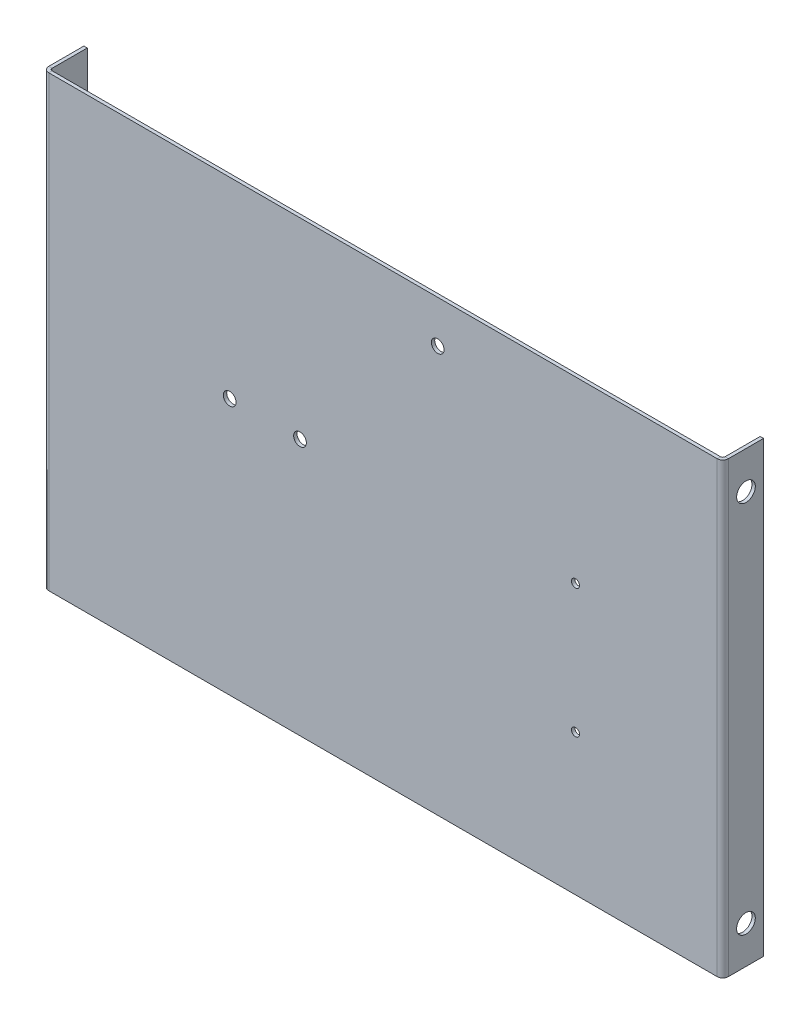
ISO-10303-21;
HEADER;
FILE_DESCRIPTION(('STEP AP214'),'2;1');
FILE_NAME('part.step','',(''),(''),'','','');
FILE_SCHEMA(('AUTOMOTIVE_DESIGN { 1 0 10303 214 1 1 1 1 }'));
ENDSEC;
DATA;
#1=APPLICATION_CONTEXT('core data for automotive mechanical design processes');
#2=APPLICATION_PROTOCOL_DEFINITION('international standard','automotive_design',2000,#1);
#3=PRODUCT_CONTEXT('',#1,'mechanical');
#4=PRODUCT('Part','Part','',(#3));
#5=PRODUCT_RELATED_PRODUCT_CATEGORY('part','',(#4));
#6=PRODUCT_DEFINITION_FORMATION('','',#4);
#7=PRODUCT_DEFINITION_CONTEXT('part definition',#1,'design');
#8=PRODUCT_DEFINITION('design','',#6,#7);
#9=PRODUCT_DEFINITION_SHAPE('','',#8);
#10=(LENGTH_UNIT() NAMED_UNIT(*) SI_UNIT(.MILLI.,.METRE.));
#11=(NAMED_UNIT(*) PLANE_ANGLE_UNIT() SI_UNIT($,.RADIAN.));
#12=(NAMED_UNIT(*) SI_UNIT($,.STERADIAN.) SOLID_ANGLE_UNIT());
#13=UNCERTAINTY_MEASURE_WITH_UNIT(LENGTH_MEASURE(1.E-05),#10,'distance_accuracy_value','');
#14=(GEOMETRIC_REPRESENTATION_CONTEXT(3) GLOBAL_UNCERTAINTY_ASSIGNED_CONTEXT((#13)) GLOBAL_UNIT_ASSIGNED_CONTEXT((#10,
#11,#12)) REPRESENTATION_CONTEXT('',''));
#15=CARTESIAN_POINT('',(0.,0.,0.));
#16=DIRECTION('',(0.,0.,1.));
#17=DIRECTION('',(1.,0.,0.));
#18=AXIS2_PLACEMENT_3D('',#15,#16,#17);
#19=CARTESIAN_POINT('',(230.886,152.4,0.));
#20=DIRECTION('',(-1.,0.,0.));
#21=DIRECTION('',(0.,0.,1.));
#22=AXIS2_PLACEMENT_3D('',#19,#20,#21);
#23=PLANE('',#22);
#24=CARTESIAN_POINT('',(230.886,127.,-13.462));
#25=DIRECTION('',(1.,0.,0.));
#26=DIRECTION('',(0.,0.,-1.));
#27=AXIS2_PLACEMENT_3D('',#24,#25,#26);
#28=CIRCLE('',#27,6.35);
#29=CARTESIAN_POINT('',(230.886,127.,-19.812));
#30=VERTEX_POINT('',#29);
#31=EDGE_CURVE('E309',#30,#30,#28,.T.);
#32=ORIENTED_EDGE('',*,*,#31,.F.);
#33=EDGE_LOOP('',(#32));
#34=FACE_BOUND('',#33,.T.);
#35=DIRECTION('',(0.,0.,-1.));
#36=VECTOR('',#35,1.);
#37=CARTESIAN_POINT('',(230.886,-152.4,0.));
#38=LINE('',#37,#36);
#39=CARTESIAN_POINT('',(230.886,-152.4,-1.52400000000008));
#40=VERTEX_POINT('',#39);
#41=CARTESIAN_POINT('',(230.886,-152.4,-25.4000000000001));
#42=VERTEX_POINT('',#41);
#43=EDGE_CURVE('E174',#40,#42,#38,.T.);
#44=ORIENTED_EDGE('',*,*,#43,.T.);
#45=DIRECTION('',(0.,-1.,0.));
#46=VECTOR('',#45,1.);
#47=CARTESIAN_POINT('',(230.886,152.4,-25.4000000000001));
#48=LINE('',#47,#46);
#49=CARTESIAN_POINT('',(230.886,152.4,-25.4000000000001));
#50=VERTEX_POINT('',#49);
#51=EDGE_CURVE('E227',#50,#42,#48,.T.);
#52=ORIENTED_EDGE('',*,*,#51,.F.);
#53=DIRECTION('',(0.,0.,-1.));
#54=VECTOR('',#53,1.);
#55=CARTESIAN_POINT('',(230.886,152.4,0.));
#56=LINE('',#55,#54);
#57=CARTESIAN_POINT('',(230.886,152.4,-1.52400000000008));
#58=VERTEX_POINT('',#57);
#59=EDGE_CURVE('E109',#58,#50,#56,.T.);
#60=ORIENTED_EDGE('',*,*,#59,.F.);
#61=DIRECTION('',(0.,-1.,0.));
#62=VECTOR('',#61,1.);
#63=CARTESIAN_POINT('',(230.886,152.4,-1.52400000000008));
#64=LINE('',#63,#62);
#65=EDGE_CURVE('E170',#58,#40,#64,.T.);
#66=ORIENTED_EDGE('',*,*,#65,.T.);
#67=EDGE_LOOP('',(#44,#52,#60,#66));
#68=FACE_BOUND('',#67,.T.);
#69=CARTESIAN_POINT('',(230.886,-127.,-13.462));
#70=DIRECTION('',(1.,0.,0.));
#71=DIRECTION('',(0.,0.,1.));
#72=AXIS2_PLACEMENT_3D('',#69,#70,#71);
#73=CIRCLE('',#72,6.34999999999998);
#74=CARTESIAN_POINT('',(230.886,-127.,-7.11200000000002));
#75=VERTEX_POINT('',#74);
#76=EDGE_CURVE('E315',#75,#75,#73,.T.);
#77=ORIENTED_EDGE('',*,*,#76,.F.);
#78=EDGE_LOOP('',(#77));
#79=FACE_BOUND('',#78,.T.);
#80=ADVANCED_FACE('F38',(#34,#68,#79),#23,.F.);
#81=CARTESIAN_POINT('',(228.6,152.4,0.));
#82=DIRECTION('',(-1.,0.,0.));
#83=DIRECTION('',(0.,0.,1.));
#84=AXIS2_PLACEMENT_3D('',#81,#82,#83);
#85=PLANE('',#84);
#86=CARTESIAN_POINT('',(228.6,127.,-13.462));
#87=DIRECTION('',(1.,0.,0.));
#88=DIRECTION('',(0.,0.,-1.));
#89=AXIS2_PLACEMENT_3D('',#86,#87,#88);
#90=CIRCLE('',#89,6.35);
#91=CARTESIAN_POINT('',(228.6,127.,-19.812));
#92=VERTEX_POINT('',#91);
#93=EDGE_CURVE('E312',#92,#92,#90,.T.);
#94=ORIENTED_EDGE('',*,*,#93,.T.);
#95=EDGE_LOOP('',(#94));
#96=FACE_BOUND('',#95,.T.);
#97=DIRECTION('',(0.,0.,-1.));
#98=VECTOR('',#97,1.);
#99=CARTESIAN_POINT('',(228.6,-152.4,0.));
#100=LINE('',#99,#98);
#101=CARTESIAN_POINT('',(228.6,-152.4,-1.52400000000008));
#102=VERTEX_POINT('',#101);
#103=CARTESIAN_POINT('',(228.6,-152.4,-25.4000000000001));
#104=VERTEX_POINT('',#103);
#105=EDGE_CURVE('E181',#102,#104,#100,.T.);
#106=ORIENTED_EDGE('',*,*,#105,.F.);
#107=DIRECTION('',(0.,-1.,0.));
#108=VECTOR('',#107,1.);
#109=CARTESIAN_POINT('',(228.6,152.4,-1.52400000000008));
#110=LINE('',#109,#108);
#111=CARTESIAN_POINT('',(228.6,152.4,-1.52400000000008));
#112=VERTEX_POINT('',#111);
#113=EDGE_CURVE('E222',#112,#102,#110,.T.);
#114=ORIENTED_EDGE('',*,*,#113,.F.);
#115=DIRECTION('',(0.,0.,-1.));
#116=VECTOR('',#115,1.);
#117=CARTESIAN_POINT('',(228.6,152.4,0.));
#118=LINE('',#117,#116);
#119=CARTESIAN_POINT('',(228.6,152.4,-25.4000000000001));
#120=VERTEX_POINT('',#119);
#121=EDGE_CURVE('E263',#112,#120,#118,.T.);
#122=ORIENTED_EDGE('',*,*,#121,.T.);
#123=DIRECTION('',(0.,-1.,0.));
#124=VECTOR('',#123,1.);
#125=CARTESIAN_POINT('',(228.6,152.4,-25.4000000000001));
#126=LINE('',#125,#124);
#127=EDGE_CURVE('E225',#120,#104,#126,.T.);
#128=ORIENTED_EDGE('',*,*,#127,.T.);
#129=EDGE_LOOP('',(#106,#114,#122,#128));
#130=FACE_BOUND('',#129,.T.);
#131=CARTESIAN_POINT('',(228.6,-127.,-13.462));
#132=DIRECTION('',(1.,0.,0.));
#133=DIRECTION('',(0.,0.,1.));
#134=AXIS2_PLACEMENT_3D('',#131,#132,#133);
#135=CIRCLE('',#134,6.34999999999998);
#136=CARTESIAN_POINT('',(228.6,-127.,-7.11200000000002));
#137=VERTEX_POINT('',#136);
#138=EDGE_CURVE('E318',#137,#137,#135,.T.);
#139=ORIENTED_EDGE('',*,*,#138,.T.);
#140=EDGE_LOOP('',(#139));
#141=FACE_BOUND('',#140,.T.);
#142=ADVANCED_FACE('F328',(#96,#130,#141),#85,.T.);
#143=CARTESIAN_POINT('',(-227.076,152.4,0.));
#144=DIRECTION('',(0.,1.,0.));
#145=DIRECTION('',(0.,0.,1.));
#146=AXIS2_PLACEMENT_3D('',#143,#144,#145);
#147=PLANE('',#146);
#148=DIRECTION('',(0.,0.,1.));
#149=VECTOR('',#148,1.);
#150=CARTESIAN_POINT('',(-227.076,152.4,0.));
#151=LINE('',#150,#149);
#152=CARTESIAN_POINT('',(-227.076,152.4,0.));
#153=VERTEX_POINT('',#152);
#154=CARTESIAN_POINT('',(-227.076,152.4,2.286));
#155=VERTEX_POINT('',#154);
#156=EDGE_CURVE('E11',#153,#155,#151,.T.);
#157=ORIENTED_EDGE('',*,*,#156,.F.);
#158=CARTESIAN_POINT('',(-227.076,152.4,-1.524));
#159=DIRECTION('',(0.,-1.,0.));
#160=DIRECTION('',(0.,0.,-1.));
#161=AXIS2_PLACEMENT_3D('',#158,#159,#160);
#162=CIRCLE('',#161,1.524);
#163=CARTESIAN_POINT('',(-228.6,152.4,-1.524));
#164=VERTEX_POINT('',#163);
#165=EDGE_CURVE('E250',#164,#153,#162,.F.);
#166=ORIENTED_EDGE('',*,*,#165,.F.);
#167=DIRECTION('',(1.,0.,0.));
#168=VECTOR('',#167,1.);
#169=CARTESIAN_POINT('',(-230.886,152.4,-1.524));
#170=LINE('',#169,#168);
#171=CARTESIAN_POINT('',(-230.886,152.4,-1.524));
#172=VERTEX_POINT('',#171);
#173=EDGE_CURVE('E47',#172,#164,#170,.T.);
#174=ORIENTED_EDGE('',*,*,#173,.F.);
#175=CARTESIAN_POINT('',(-227.076,152.4,-1.524));
#176=DIRECTION('',(0.,1.,0.));
#177=DIRECTION('',(1.,0.,0.));
#178=AXIS2_PLACEMENT_3D('',#175,#176,#177);
#179=CIRCLE('',#178,3.81);
#180=EDGE_CURVE('E148',#172,#155,#179,.T.);
#181=ORIENTED_EDGE('',*,*,#180,.T.);
#182=EDGE_LOOP('',(#157,#166,#174,#181));
#183=FACE_BOUND('',#182,.T.);
#184=ADVANCED_FACE('F40',(#183),#147,.T.);
#185=CARTESIAN_POINT('',(-230.886,152.4,-1.524));
#186=DIRECTION('',(0.,1.,0.));
#187=DIRECTION('',(0.,0.,1.));
#188=AXIS2_PLACEMENT_3D('',#185,#186,#187);
#189=PLANE('',#188);
#190=DIRECTION('',(1.,0.,0.));
#191=VECTOR('',#190,1.);
#192=CARTESIAN_POINT('',(-228.6,152.4,0.));
#193=LINE('',#192,#191);
#194=CARTESIAN_POINT('',(227.076,152.4,0.));
#195=VERTEX_POINT('',#194);
#196=EDGE_CURVE('E142',#153,#195,#193,.T.);
#197=ORIENTED_EDGE('',*,*,#196,.F.);
#198=ORIENTED_EDGE('',*,*,#156,.T.);
#199=DIRECTION('',(1.,0.,0.));
#200=VECTOR('',#199,1.);
#201=CARTESIAN_POINT('',(-228.6,152.4,2.286));
#202=LINE('',#201,#200);
#203=CARTESIAN_POINT('',(227.076,152.4,2.28599999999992));
#204=VERTEX_POINT('',#203);
#205=EDGE_CURVE('E139',#155,#204,#202,.T.);
#206=ORIENTED_EDGE('',*,*,#205,.T.);
#207=DIRECTION('',(0.,0.,-1.));
#208=VECTOR('',#207,1.);
#209=CARTESIAN_POINT('',(227.076,152.4,2.28599999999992));
#210=LINE('',#209,#208);
#211=EDGE_CURVE('E231',#204,#195,#210,.T.);
#212=ORIENTED_EDGE('',*,*,#211,.T.);
#213=EDGE_LOOP('',(#197,#198,#206,#212));
#214=FACE_BOUND('',#213,.T.);
#215=ADVANCED_FACE('F137',(#214),#189,.T.);
#216=CARTESIAN_POINT('',(-228.6,-152.4,-1.524));
#217=DIRECTION('',(0.,-1.,0.));
#218=DIRECTION('',(0.,0.,-1.));
#219=AXIS2_PLACEMENT_3D('',#216,#217,#218);
#220=PLANE('',#219);
#221=DIRECTION('',(-1.,0.,0.));
#222=VECTOR('',#221,1.);
#223=CARTESIAN_POINT('',(-228.6,-152.4,-1.524));
#224=LINE('',#223,#222);
#225=CARTESIAN_POINT('',(-228.6,-152.4,-1.524));
#226=VERTEX_POINT('',#225);
#227=CARTESIAN_POINT('',(-230.886,-152.4,-1.524));
#228=VERTEX_POINT('',#227);
#229=EDGE_CURVE('E236',#226,#228,#224,.T.);
#230=ORIENTED_EDGE('',*,*,#229,.F.);
#231=CARTESIAN_POINT('',(-227.076,-152.4,-1.524));
#232=DIRECTION('',(0.,-1.,0.));
#233=DIRECTION('',(0.,0.,-1.));
#234=AXIS2_PLACEMENT_3D('',#231,#232,#233);
#235=CIRCLE('',#234,1.524);
#236=CARTESIAN_POINT('',(-227.076,-152.4,0.));
#237=VERTEX_POINT('',#236);
#238=EDGE_CURVE('E188',#226,#237,#235,.F.);
#239=ORIENTED_EDGE('',*,*,#238,.T.);
#240=DIRECTION('',(0.,0.,-1.));
#241=VECTOR('',#240,1.);
#242=CARTESIAN_POINT('',(-227.076,-152.4,2.286));
#243=LINE('',#242,#241);
#244=CARTESIAN_POINT('',(-227.076,-152.4,2.286));
#245=VERTEX_POINT('',#244);
#246=EDGE_CURVE('E234',#245,#237,#243,.T.);
#247=ORIENTED_EDGE('',*,*,#246,.F.);
#248=CARTESIAN_POINT('',(-227.076,-152.4,-1.524));
#249=DIRECTION('',(0.,1.,0.));
#250=DIRECTION('',(1.,0.,0.));
#251=AXIS2_PLACEMENT_3D('',#248,#249,#250);
#252=CIRCLE('',#251,3.81);
#253=EDGE_CURVE('E160',#228,#245,#252,.T.);
#254=ORIENTED_EDGE('',*,*,#253,.F.);
#255=EDGE_LOOP('',(#230,#239,#247,#254));
#256=FACE_BOUND('',#255,.T.);
#257=ADVANCED_FACE('F357',(#256),#220,.T.);
#258=CARTESIAN_POINT('',(-227.076,-152.4,2.286));
#259=DIRECTION('',(0.,-1.,0.));
#260=DIRECTION('',(0.,0.,-1.));
#261=AXIS2_PLACEMENT_3D('',#258,#259,#260);
#262=PLANE('',#261);
#263=DIRECTION('',(0.,0.,1.));
#264=VECTOR('',#263,1.);
#265=CARTESIAN_POINT('',(-228.6,-152.4,0.));
#266=LINE('',#265,#264);
#267=CARTESIAN_POINT('',(-228.6,-152.4,-25.4));
#268=VERTEX_POINT('',#267);
#269=EDGE_CURVE('E191',#268,#226,#266,.T.);
#270=ORIENTED_EDGE('',*,*,#269,.T.);
#271=ORIENTED_EDGE('',*,*,#229,.T.);
#272=DIRECTION('',(0.,0.,-1.));
#273=VECTOR('',#272,1.);
#274=CARTESIAN_POINT('',(-230.886,-152.4,0.));
#275=LINE('',#274,#273);
#276=CARTESIAN_POINT('',(-230.886,-152.4,-25.4));
#277=VERTEX_POINT('',#276);
#278=EDGE_CURVE('E197',#277,#228,#275,.F.);
#279=ORIENTED_EDGE('',*,*,#278,.F.);
#280=DIRECTION('',(1.,0.,0.));
#281=VECTOR('',#280,1.);
#282=CARTESIAN_POINT('',(-230.886,-152.4,-25.4));
#283=LINE('',#282,#281);
#284=EDGE_CURVE('E194',#277,#268,#283,.T.);
#285=ORIENTED_EDGE('',*,*,#284,.T.);
#286=EDGE_LOOP('',(#270,#271,#279,#285));
#287=FACE_BOUND('',#286,.T.);
#288=ADVANCED_FACE('F353',(#287),#262,.T.);
#289=CARTESIAN_POINT('',(228.6,152.4,-1.52400000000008));
#290=DIRECTION('',(0.,1.,0.));
#291=DIRECTION('',(0.,0.,1.));
#292=AXIS2_PLACEMENT_3D('',#289,#290,#291);
#293=PLANE('',#292);
#294=DIRECTION('',(1.,0.,0.));
#295=VECTOR('',#294,1.);
#296=CARTESIAN_POINT('',(228.6,152.4,-1.52400000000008));
#297=LINE('',#296,#295);
#298=EDGE_CURVE('E55',#112,#58,#297,.T.);
#299=ORIENTED_EDGE('',*,*,#298,.F.);
#300=CARTESIAN_POINT('',(227.076,152.4,-1.52400000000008));
#301=DIRECTION('',(0.,-1.,0.));
#302=DIRECTION('',(0.,0.,-1.));
#303=AXIS2_PLACEMENT_3D('',#300,#301,#302);
#304=CIRCLE('',#303,1.524);
#305=EDGE_CURVE('E260',#195,#112,#304,.F.);
#306=ORIENTED_EDGE('',*,*,#305,.F.);
#307=ORIENTED_EDGE('',*,*,#211,.F.);
#308=CARTESIAN_POINT('',(227.076,152.4,-1.52400000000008));
#309=DIRECTION('',(0.,1.,0.));
#310=DIRECTION('',(1.,0.,0.));
#311=AXIS2_PLACEMENT_3D('',#308,#309,#310);
#312=CIRCLE('',#311,3.81);
#313=EDGE_CURVE('E168',#204,#58,#312,.T.);
#314=ORIENTED_EDGE('',*,*,#313,.T.);
#315=EDGE_LOOP('',(#299,#306,#307,#314));
#316=FACE_BOUND('',#315,.T.);
#317=ADVANCED_FACE('F350',(#316),#293,.T.);
#318=CARTESIAN_POINT('',(227.076,152.4,2.28599999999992));
#319=DIRECTION('',(0.,1.,0.));
#320=DIRECTION('',(0.,0.,1.));
#321=AXIS2_PLACEMENT_3D('',#318,#319,#320);
#322=PLANE('',#321);
#323=ORIENTED_EDGE('',*,*,#121,.F.);
#324=ORIENTED_EDGE('',*,*,#298,.T.);
#325=ORIENTED_EDGE('',*,*,#59,.T.);
#326=DIRECTION('',(1.,0.,0.));
#327=VECTOR('',#326,1.);
#328=CARTESIAN_POINT('',(228.6,152.4,-25.4000000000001));
#329=LINE('',#328,#327);
#330=EDGE_CURVE('E266',#120,#50,#329,.T.);
#331=ORIENTED_EDGE('',*,*,#330,.F.);
#332=EDGE_LOOP('',(#323,#324,#325,#331));
#333=FACE_BOUND('',#332,.T.);
#334=ADVANCED_FACE('F347',(#333),#322,.T.);
#335=CARTESIAN_POINT('',(227.076,-152.4,0.));
#336=DIRECTION('',(0.,-1.,0.));
#337=DIRECTION('',(0.,0.,-1.));
#338=AXIS2_PLACEMENT_3D('',#335,#336,#337);
#339=PLANE('',#338);
#340=DIRECTION('',(0.,0.,1.));
#341=VECTOR('',#340,1.);
#342=CARTESIAN_POINT('',(227.076,-152.4,0.));
#343=LINE('',#342,#341);
#344=CARTESIAN_POINT('',(227.076,-152.4,0.));
#345=VERTEX_POINT('',#344);
#346=CARTESIAN_POINT('',(227.076,-152.4,2.28599999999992));
#347=VERTEX_POINT('',#346);
#348=EDGE_CURVE('E96',#345,#347,#343,.T.);
#349=ORIENTED_EDGE('',*,*,#348,.F.);
#350=CARTESIAN_POINT('',(227.076,-152.4,-1.52400000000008));
#351=DIRECTION('',(0.,-1.,0.));
#352=DIRECTION('',(0.,0.,-1.));
#353=AXIS2_PLACEMENT_3D('',#350,#351,#352);
#354=CIRCLE('',#353,1.524);
#355=EDGE_CURVE('E184',#345,#102,#354,.F.);
#356=ORIENTED_EDGE('',*,*,#355,.T.);
#357=DIRECTION('',(-1.,0.,0.));
#358=VECTOR('',#357,1.);
#359=CARTESIAN_POINT('',(230.886,-152.4,-1.52400000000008));
#360=LINE('',#359,#358);
#361=EDGE_CURVE('E103',#40,#102,#360,.T.);
#362=ORIENTED_EDGE('',*,*,#361,.F.);
#363=CARTESIAN_POINT('',(227.076,-152.4,-1.52400000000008));
#364=DIRECTION('',(0.,1.,0.));
#365=DIRECTION('',(1.,0.,0.));
#366=AXIS2_PLACEMENT_3D('',#363,#364,#365);
#367=CIRCLE('',#366,3.81);
#368=EDGE_CURVE('E203',#347,#40,#367,.T.);
#369=ORIENTED_EDGE('',*,*,#368,.F.);
#370=EDGE_LOOP('',(#349,#356,#362,#369));
#371=FACE_BOUND('',#370,.T.);
#372=ADVANCED_FACE('F344',(#371),#339,.T.);
#373=CARTESIAN_POINT('',(230.886,-152.4,-1.52400000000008));
#374=DIRECTION('',(0.,-1.,0.));
#375=DIRECTION('',(0.,0.,-1.));
#376=AXIS2_PLACEMENT_3D('',#373,#374,#375);
#377=PLANE('',#376);
#378=DIRECTION('',(1.,0.,0.));
#379=VECTOR('',#378,1.);
#380=CARTESIAN_POINT('',(-228.6,-152.4,0.));
#381=LINE('',#380,#379);
#382=EDGE_CURVE('E186',#237,#345,#381,.T.);
#383=ORIENTED_EDGE('',*,*,#382,.T.);
#384=ORIENTED_EDGE('',*,*,#348,.T.);
#385=DIRECTION('',(1.,0.,0.));
#386=VECTOR('',#385,1.);
#387=CARTESIAN_POINT('',(-228.6,-152.4,2.286));
#388=LINE('',#387,#386);
#389=EDGE_CURVE('E201',#245,#347,#388,.T.);
#390=ORIENTED_EDGE('',*,*,#389,.F.);
#391=ORIENTED_EDGE('',*,*,#246,.T.);
#392=EDGE_LOOP('',(#383,#384,#390,#391));
#393=FACE_BOUND('',#392,.T.);
#394=ADVANCED_FACE('F341',(#393),#377,.T.);
#395=CARTESIAN_POINT('',(228.6,152.4,-25.4000000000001));
#396=DIRECTION('',(0.,0.,-1.));
#397=DIRECTION('',(-1.,0.,0.));
#398=AXIS2_PLACEMENT_3D('',#395,#396,#397);
#399=PLANE('',#398);
#400=DIRECTION('',(1.,0.,0.));
#401=VECTOR('',#400,1.);
#402=CARTESIAN_POINT('',(228.6,-152.4,-25.4000000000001));
#403=LINE('',#402,#401);
#404=EDGE_CURVE('E177',#104,#42,#403,.T.);
#405=ORIENTED_EDGE('',*,*,#404,.F.);
#406=ORIENTED_EDGE('',*,*,#127,.F.);
#407=ORIENTED_EDGE('',*,*,#330,.T.);
#408=ORIENTED_EDGE('',*,*,#51,.T.);
#409=EDGE_LOOP('',(#405,#406,#407,#408));
#410=FACE_BOUND('',#409,.T.);
#411=ADVANCED_FACE('F340',(#410),#399,.T.);
#412=CARTESIAN_POINT('',(227.076,152.4,-1.52400000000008));
#413=DIRECTION('',(0.,-1.,0.));
#414=DIRECTION('',(0.,0.,-1.));
#415=AXIS2_PLACEMENT_3D('',#412,#413,#414);
#416=CYLINDRICAL_SURFACE('',#415,1.524);
#417=ORIENTED_EDGE('',*,*,#355,.F.);
#418=DIRECTION('',(0.,-1.,0.));
#419=VECTOR('',#418,1.);
#420=CARTESIAN_POINT('',(227.076,152.4,0.));
#421=LINE('',#420,#419);
#422=EDGE_CURVE('E219',#195,#345,#421,.T.);
#423=ORIENTED_EDGE('',*,*,#422,.F.);
#424=ORIENTED_EDGE('',*,*,#305,.T.);
#425=ORIENTED_EDGE('',*,*,#113,.T.);
#426=EDGE_LOOP('',(#417,#423,#424,#425));
#427=FACE_BOUND('',#426,.T.);
#428=ADVANCED_FACE('F526',(#427),#416,.F.);
#429=CARTESIAN_POINT('',(-228.6,152.4,0.));
#430=DIRECTION('',(0.,0.,-1.));
#431=DIRECTION('',(-1.,0.,0.));
#432=AXIS2_PLACEMENT_3D('',#429,#430,#431);
#433=PLANE('',#432);
#434=CARTESIAN_POINT('',(-104.14,22.0979999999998,0.));
#435=DIRECTION('',(0.,0.,-1.));
#436=DIRECTION('',(-1.,0.,0.));
#437=AXIS2_PLACEMENT_3D('',#434,#435,#436);
#438=CIRCLE('',#437,4.31800000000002);
#439=CARTESIAN_POINT('',(-108.458,22.0979999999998,0.));
#440=VERTEX_POINT('',#439);
#441=EDGE_CURVE('E294',#440,#440,#438,.T.);
#442=ORIENTED_EDGE('',*,*,#441,.F.);
#443=EDGE_LOOP('',(#442));
#444=FACE_BOUND('',#443,.T.);
#445=CARTESIAN_POINT('',(-56.388,22.0979999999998,0.));
#446=DIRECTION('',(0.,0.,-1.));
#447=DIRECTION('',(-1.,0.,0.));
#448=AXIS2_PLACEMENT_3D('',#445,#446,#447);
#449=CIRCLE('',#448,4.318);
#450=CARTESIAN_POINT('',(-60.706,22.0979999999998,0.));
#451=VERTEX_POINT('',#450);
#452=EDGE_CURVE('E288',#451,#451,#449,.T.);
#453=ORIENTED_EDGE('',*,*,#452,.F.);
#454=EDGE_LOOP('',(#453));
#455=FACE_BOUND('',#454,.T.);
#456=CARTESIAN_POINT('',(37.199,123.698,0.));
#457=DIRECTION('',(0.,0.,-1.));
#458=DIRECTION('',(-1.,0.,0.));
#459=AXIS2_PLACEMENT_3D('',#456,#457,#458);
#460=CIRCLE('',#459,4.31799999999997);
#461=CARTESIAN_POINT('',(32.8810000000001,123.698,0.));
#462=VERTEX_POINT('',#461);
#463=EDGE_CURVE('E282',#462,#462,#460,.T.);
#464=ORIENTED_EDGE('',*,*,#463,.F.);
#465=EDGE_LOOP('',(#464));
#466=FACE_BOUND('',#465,.T.);
#467=CARTESIAN_POINT('',(130.786,-56.6000000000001,0.));
#468=DIRECTION('',(0.,0.,1.));
#469=DIRECTION('',(1.,0.,0.));
#470=AXIS2_PLACEMENT_3D('',#467,#468,#469);
#471=CIRCLE('',#470,2.75000000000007);
#472=CARTESIAN_POINT('',(133.536,-56.6000000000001,0.));
#473=VERTEX_POINT('',#472);
#474=EDGE_CURVE('E273',#473,#473,#471,.T.);
#475=ORIENTED_EDGE('',*,*,#474,.T.);
#476=EDGE_LOOP('',(#475));
#477=FACE_BOUND('',#476,.T.);
#478=CARTESIAN_POINT('',(130.786,30.9000000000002,0.));
#479=DIRECTION('',(0.,0.,1.));
#480=DIRECTION('',(1.,0.,0.));
#481=AXIS2_PLACEMENT_3D('',#478,#479,#480);
#482=CIRCLE('',#481,2.75000000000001);
#483=CARTESIAN_POINT('',(133.536,30.9000000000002,0.));
#484=VERTEX_POINT('',#483);
#485=EDGE_CURVE('E178',#484,#484,#482,.T.);
#486=ORIENTED_EDGE('',*,*,#485,.T.);
#487=EDGE_LOOP('',(#486));
#488=FACE_BOUND('',#487,.T.);
#489=ORIENTED_EDGE('',*,*,#382,.F.);
#490=DIRECTION('',(0.,-1.,0.));
#491=VECTOR('',#490,1.);
#492=CARTESIAN_POINT('',(-227.076,152.4,0.));
#493=LINE('',#492,#491);
#494=EDGE_CURVE('E216',#153,#237,#493,.T.);
#495=ORIENTED_EDGE('',*,*,#494,.F.);
#496=ORIENTED_EDGE('',*,*,#196,.T.);
#497=ORIENTED_EDGE('',*,*,#422,.T.);
#498=EDGE_LOOP('',(#489,#495,#496,#497));
#499=FACE_BOUND('',#498,.T.);
#500=ADVANCED_FACE('F519',(#444,#455,#466,#477,#488,#499),#433,.T.);
#501=CARTESIAN_POINT('',(-227.076,152.4,-1.524));
#502=DIRECTION('',(0.,-1.,0.));
#503=DIRECTION('',(0.,0.,-1.));
#504=AXIS2_PLACEMENT_3D('',#501,#502,#503);
#505=CYLINDRICAL_SURFACE('',#504,1.524);
#506=ORIENTED_EDGE('',*,*,#238,.F.);
#507=DIRECTION('',(0.,-1.,0.));
#508=VECTOR('',#507,1.);
#509=CARTESIAN_POINT('',(-228.6,152.4,-1.524));
#510=LINE('',#509,#508);
#511=EDGE_CURVE('E213',#164,#226,#510,.T.);
#512=ORIENTED_EDGE('',*,*,#511,.F.);
#513=ORIENTED_EDGE('',*,*,#165,.T.);
#514=ORIENTED_EDGE('',*,*,#494,.T.);
#515=EDGE_LOOP('',(#506,#512,#513,#514));
#516=FACE_BOUND('',#515,.T.);
#517=ADVANCED_FACE('F249',(#516),#505,.F.);
#518=CARTESIAN_POINT('',(-228.6,152.4,0.));
#519=DIRECTION('',(1.,0.,0.));
#520=DIRECTION('',(0.,0.,-1.));
#521=AXIS2_PLACEMENT_3D('',#518,#519,#520);
#522=PLANE('',#521);
#523=CARTESIAN_POINT('',(-228.6,-127.,-13.462));
#524=DIRECTION('',(1.,0.,0.));
#525=DIRECTION('',(0.,0.,1.));
#526=AXIS2_PLACEMENT_3D('',#523,#524,#525);
#527=CIRCLE('',#526,6.34999999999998);
#528=CARTESIAN_POINT('',(-228.6,-127.,-7.11200000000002));
#529=VERTEX_POINT('',#528);
#530=EDGE_CURVE('E306',#529,#529,#527,.T.);
#531=ORIENTED_EDGE('',*,*,#530,.F.);
#532=EDGE_LOOP('',(#531));
#533=FACE_BOUND('',#532,.T.);
#534=CARTESIAN_POINT('',(-228.6,127.,-13.462));
#535=DIRECTION('',(1.,0.,0.));
#536=DIRECTION('',(0.,0.,-1.));
#537=AXIS2_PLACEMENT_3D('',#534,#535,#536);
#538=CIRCLE('',#537,6.35);
#539=CARTESIAN_POINT('',(-228.6,127.,-19.812));
#540=VERTEX_POINT('',#539);
#541=EDGE_CURVE('E300',#540,#540,#538,.T.);
#542=ORIENTED_EDGE('',*,*,#541,.F.);
#543=EDGE_LOOP('',(#542));
#544=FACE_BOUND('',#543,.T.);
#545=ORIENTED_EDGE('',*,*,#269,.F.);
#546=DIRECTION('',(0.,-1.,0.));
#547=VECTOR('',#546,1.);
#548=CARTESIAN_POINT('',(-228.6,152.4,-25.4));
#549=LINE('',#548,#547);
#550=CARTESIAN_POINT('',(-228.6,152.4,-25.4));
#551=VERTEX_POINT('',#550);
#552=EDGE_CURVE('E211',#551,#268,#549,.T.);
#553=ORIENTED_EDGE('',*,*,#552,.F.);
#554=DIRECTION('',(0.,0.,1.));
#555=VECTOR('',#554,1.);
#556=CARTESIAN_POINT('',(-228.6,152.4,0.));
#557=LINE('',#556,#555);
#558=EDGE_CURVE('E243',#551,#164,#557,.T.);
#559=ORIENTED_EDGE('',*,*,#558,.T.);
#560=ORIENTED_EDGE('',*,*,#511,.T.);
#561=EDGE_LOOP('',(#545,#553,#559,#560));
#562=FACE_BOUND('',#561,.T.);
#563=ADVANCED_FACE('F254',(#533,#544,#562),#522,.T.);
#564=CARTESIAN_POINT('',(-230.886,152.4,-25.4));
#565=DIRECTION('',(0.,0.,-1.));
#566=DIRECTION('',(-1.,0.,0.));
#567=AXIS2_PLACEMENT_3D('',#564,#565,#566);
#568=PLANE('',#567);
#569=ORIENTED_EDGE('',*,*,#284,.F.);
#570=DIRECTION('',(0.,-1.,0.));
#571=VECTOR('',#570,1.);
#572=CARTESIAN_POINT('',(-230.886,152.4,-25.4));
#573=LINE('',#572,#571);
#574=CARTESIAN_POINT('',(-230.886,152.4,-25.4));
#575=VERTEX_POINT('',#574);
#576=EDGE_CURVE('E209',#575,#277,#573,.T.);
#577=ORIENTED_EDGE('',*,*,#576,.F.);
#578=DIRECTION('',(1.,0.,0.));
#579=VECTOR('',#578,1.);
#580=CARTESIAN_POINT('',(-230.886,152.4,-25.4));
#581=LINE('',#580,#579);
#582=EDGE_CURVE('E255',#575,#551,#581,.T.);
#583=ORIENTED_EDGE('',*,*,#582,.T.);
#584=ORIENTED_EDGE('',*,*,#552,.T.);
#585=EDGE_LOOP('',(#569,#577,#583,#584));
#586=FACE_BOUND('',#585,.T.);
#587=ADVANCED_FACE('F499',(#586),#568,.T.);
#588=CARTESIAN_POINT('',(-230.886,152.4,0.));
#589=DIRECTION('',(1.,0.,0.));
#590=DIRECTION('',(0.,0.,-1.));
#591=AXIS2_PLACEMENT_3D('',#588,#589,#590);
#592=PLANE('',#591);
#593=CARTESIAN_POINT('',(-230.886,-127.,-13.462));
#594=DIRECTION('',(1.,0.,0.));
#595=DIRECTION('',(0.,0.,1.));
#596=AXIS2_PLACEMENT_3D('',#593,#594,#595);
#597=CIRCLE('',#596,6.34999999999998);
#598=CARTESIAN_POINT('',(-230.886,-127.,-7.11200000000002));
#599=VERTEX_POINT('',#598);
#600=EDGE_CURVE('E303',#599,#599,#597,.T.);
#601=ORIENTED_EDGE('',*,*,#600,.T.);
#602=EDGE_LOOP('',(#601));
#603=FACE_BOUND('',#602,.T.);
#604=CARTESIAN_POINT('',(-230.886,127.,-13.462));
#605=DIRECTION('',(1.,0.,0.));
#606=DIRECTION('',(0.,0.,-1.));
#607=AXIS2_PLACEMENT_3D('',#604,#605,#606);
#608=CIRCLE('',#607,6.35);
#609=CARTESIAN_POINT('',(-230.886,127.,-19.812));
#610=VERTEX_POINT('',#609);
#611=EDGE_CURVE('E297',#610,#610,#608,.T.);
#612=ORIENTED_EDGE('',*,*,#611,.T.);
#613=EDGE_LOOP('',(#612));
#614=FACE_BOUND('',#613,.T.);
#615=ORIENTED_EDGE('',*,*,#278,.T.);
#616=DIRECTION('',(0.,-1.,0.));
#617=VECTOR('',#616,1.);
#618=CARTESIAN_POINT('',(-230.886,152.4,-1.524));
#619=LINE('',#618,#617);
#620=EDGE_CURVE('E162',#172,#228,#619,.T.);
#621=ORIENTED_EDGE('',*,*,#620,.F.);
#622=DIRECTION('',(0.,0.,-1.));
#623=VECTOR('',#622,1.);
#624=CARTESIAN_POINT('',(-230.886,152.4,0.));
#625=LINE('',#624,#623);
#626=EDGE_CURVE('E153',#575,#172,#625,.F.);
#627=ORIENTED_EDGE('',*,*,#626,.F.);
#628=ORIENTED_EDGE('',*,*,#576,.T.);
#629=EDGE_LOOP('',(#615,#621,#627,#628));
#630=FACE_BOUND('',#629,.T.);
#631=ADVANCED_FACE('F492',(#603,#614,#630),#592,.F.);
#632=CARTESIAN_POINT('',(-227.076,152.4,-1.524));
#633=DIRECTION('',(0.,-1.,0.));
#634=DIRECTION('',(0.,0.,-1.));
#635=AXIS2_PLACEMENT_3D('',#632,#633,#634);
#636=CYLINDRICAL_SURFACE('',#635,3.81);
#637=ORIENTED_EDGE('',*,*,#253,.T.);
#638=DIRECTION('',(0.,-1.,0.));
#639=VECTOR('',#638,1.);
#640=CARTESIAN_POINT('',(-227.076,152.4,2.286));
#641=LINE('',#640,#639);
#642=EDGE_CURVE('E157',#155,#245,#641,.T.);
#643=ORIENTED_EDGE('',*,*,#642,.F.);
#644=ORIENTED_EDGE('',*,*,#180,.F.);
#645=ORIENTED_EDGE('',*,*,#620,.T.);
#646=EDGE_LOOP('',(#637,#643,#644,#645));
#647=FACE_BOUND('',#646,.T.);
#648=ADVANCED_FACE('F158',(#647),#636,.T.);
#649=CARTESIAN_POINT('',(-228.6,152.4,2.286));
#650=DIRECTION('',(0.,0.,-1.));
#651=DIRECTION('',(-1.,0.,0.));
#652=AXIS2_PLACEMENT_3D('',#649,#650,#651);
#653=PLANE('',#652);
#654=CARTESIAN_POINT('',(-104.14,22.0979999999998,2.28600000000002));
#655=DIRECTION('',(0.,0.,-1.));
#656=DIRECTION('',(-1.,0.,0.));
#657=AXIS2_PLACEMENT_3D('',#654,#655,#656);
#658=CIRCLE('',#657,4.31800000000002);
#659=CARTESIAN_POINT('',(-108.458,22.0979999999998,2.28600000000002));
#660=VERTEX_POINT('',#659);
#661=EDGE_CURVE('E291',#660,#660,#658,.T.);
#662=ORIENTED_EDGE('',*,*,#661,.T.);
#663=EDGE_LOOP('',(#662));
#664=FACE_BOUND('',#663,.T.);
#665=CARTESIAN_POINT('',(-56.388,22.0979999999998,2.28600000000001));
#666=DIRECTION('',(0.,0.,-1.));
#667=DIRECTION('',(-1.,0.,0.));
#668=AXIS2_PLACEMENT_3D('',#665,#666,#667);
#669=CIRCLE('',#668,4.318);
#670=CARTESIAN_POINT('',(-60.706,22.0979999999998,2.28600000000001));
#671=VERTEX_POINT('',#670);
#672=EDGE_CURVE('E285',#671,#671,#669,.T.);
#673=ORIENTED_EDGE('',*,*,#672,.T.);
#674=EDGE_LOOP('',(#673));
#675=FACE_BOUND('',#674,.T.);
#676=CARTESIAN_POINT('',(37.199,123.698,2.28599999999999));
#677=DIRECTION('',(0.,0.,-1.));
#678=DIRECTION('',(-1.,0.,0.));
#679=AXIS2_PLACEMENT_3D('',#676,#677,#678);
#680=CIRCLE('',#679,4.31799999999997);
#681=CARTESIAN_POINT('',(32.8810000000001,123.698,2.28599999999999));
#682=VERTEX_POINT('',#681);
#683=EDGE_CURVE('E279',#682,#682,#680,.T.);
#684=ORIENTED_EDGE('',*,*,#683,.T.);
#685=EDGE_LOOP('',(#684));
#686=FACE_BOUND('',#685,.T.);
#687=CARTESIAN_POINT('',(130.786,-56.6000000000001,2.28599999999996));
#688=DIRECTION('',(0.,0.,1.));
#689=DIRECTION('',(1.,0.,0.));
#690=AXIS2_PLACEMENT_3D('',#687,#688,#689);
#691=CIRCLE('',#690,2.75000000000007);
#692=CARTESIAN_POINT('',(133.536,-56.6000000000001,2.28599999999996));
#693=VERTEX_POINT('',#692);
#694=EDGE_CURVE('E276',#693,#693,#691,.T.);
#695=ORIENTED_EDGE('',*,*,#694,.F.);
#696=EDGE_LOOP('',(#695));
#697=FACE_BOUND('',#696,.T.);
#698=CARTESIAN_POINT('',(130.786,30.9000000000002,2.28599999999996));
#699=DIRECTION('',(0.,0.,1.));
#700=DIRECTION('',(1.,0.,0.));
#701=AXIS2_PLACEMENT_3D('',#698,#699,#700);
#702=CIRCLE('',#701,2.75000000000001);
#703=CARTESIAN_POINT('',(133.536,30.9000000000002,2.28599999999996));
#704=VERTEX_POINT('',#703);
#705=EDGE_CURVE('E270',#704,#704,#702,.T.);
#706=ORIENTED_EDGE('',*,*,#705,.F.);
#707=EDGE_LOOP('',(#706));
#708=FACE_BOUND('',#707,.T.);
#709=ORIENTED_EDGE('',*,*,#389,.T.);
#710=DIRECTION('',(0.,-1.,0.));
#711=VECTOR('',#710,1.);
#712=CARTESIAN_POINT('',(227.076,152.4,2.28599999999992));
#713=LINE('',#712,#711);
#714=EDGE_CURVE('E163',#204,#347,#713,.T.);
#715=ORIENTED_EDGE('',*,*,#714,.F.);
#716=ORIENTED_EDGE('',*,*,#205,.F.);
#717=ORIENTED_EDGE('',*,*,#642,.T.);
#718=EDGE_LOOP('',(#709,#715,#716,#717));
#719=FACE_BOUND('',#718,.T.);
#720=ADVANCED_FACE('F165',(#664,#675,#686,#697,#708,#719),#653,.F.);
#721=CARTESIAN_POINT('',(227.076,152.4,-1.52400000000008));
#722=DIRECTION('',(0.,-1.,0.));
#723=DIRECTION('',(0.,0.,-1.));
#724=AXIS2_PLACEMENT_3D('',#721,#722,#723);
#725=CYLINDRICAL_SURFACE('',#724,3.81);
#726=ORIENTED_EDGE('',*,*,#368,.T.);
#727=ORIENTED_EDGE('',*,*,#65,.F.);
#728=ORIENTED_EDGE('',*,*,#313,.F.);
#729=ORIENTED_EDGE('',*,*,#714,.T.);
#730=EDGE_LOOP('',(#726,#727,#728,#729));
#731=FACE_BOUND('',#730,.T.);
#732=ADVANCED_FACE('F472',(#731),#725,.T.);
#733=CARTESIAN_POINT('',(227.076,152.4,-1.52400000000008));
#734=DIRECTION('',(0.,-1.,0.));
#735=DIRECTION('',(-1.,0.,0.));
#736=AXIS2_PLACEMENT_3D('',#733,#734,#735);
#737=PLANE('',#736);
#738=ORIENTED_EDGE('',*,*,#626,.T.);
#739=ORIENTED_EDGE('',*,*,#173,.T.);
#740=ORIENTED_EDGE('',*,*,#558,.F.);
#741=ORIENTED_EDGE('',*,*,#582,.F.);
#742=EDGE_LOOP('',(#738,#739,#740,#741));
#743=FACE_BOUND('',#742,.T.);
#744=ADVANCED_FACE('F240',(#743),#737,.F.);
#745=CARTESIAN_POINT('',(227.076,-152.4,-1.52400000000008));
#746=DIRECTION('',(0.,-1.,0.));
#747=DIRECTION('',(-1.,0.,0.));
#748=AXIS2_PLACEMENT_3D('',#745,#746,#747);
#749=PLANE('',#748);
#750=ORIENTED_EDGE('',*,*,#43,.F.);
#751=ORIENTED_EDGE('',*,*,#361,.T.);
#752=ORIENTED_EDGE('',*,*,#105,.T.);
#753=ORIENTED_EDGE('',*,*,#404,.T.);
#754=EDGE_LOOP('',(#750,#751,#752,#753));
#755=FACE_BOUND('',#754,.T.);
#756=ADVANCED_FACE('F457',(#755),#749,.T.);
#757=CARTESIAN_POINT('',(130.786,30.9000000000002,0.));
#758=DIRECTION('',(0.,0.,1.));
#759=DIRECTION('',(1.,0.,0.));
#760=AXIS2_PLACEMENT_3D('',#757,#758,#759);
#761=CYLINDRICAL_SURFACE('',#760,2.75000000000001);
#762=ORIENTED_EDGE('',*,*,#485,.F.);
#763=EDGE_LOOP('',(#762));
#764=FACE_BOUND('',#763,.T.);
#765=ORIENTED_EDGE('',*,*,#705,.T.);
#766=EDGE_LOOP('',(#765));
#767=FACE_BOUND('',#766,.T.);
#768=ADVANCED_FACE('F448',(#764,#767),#761,.F.);
#769=CARTESIAN_POINT('',(130.786,-56.6000000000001,0.));
#770=DIRECTION('',(0.,0.,1.));
#771=DIRECTION('',(1.,0.,0.));
#772=AXIS2_PLACEMENT_3D('',#769,#770,#771);
#773=CYLINDRICAL_SURFACE('',#772,2.75000000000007);
#774=ORIENTED_EDGE('',*,*,#474,.F.);
#775=EDGE_LOOP('',(#774));
#776=FACE_BOUND('',#775,.T.);
#777=ORIENTED_EDGE('',*,*,#694,.T.);
#778=EDGE_LOOP('',(#777));
#779=FACE_BOUND('',#778,.T.);
#780=ADVANCED_FACE('F439',(#776,#779),#773,.F.);
#781=CARTESIAN_POINT('',(37.199,123.698,2.28599999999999));
#782=DIRECTION('',(0.,0.,-1.));
#783=DIRECTION('',(-1.,0.,0.));
#784=AXIS2_PLACEMENT_3D('',#781,#782,#783);
#785=CYLINDRICAL_SURFACE('',#784,4.31799999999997);
#786=ORIENTED_EDGE('',*,*,#683,.F.);
#787=EDGE_LOOP('',(#786));
#788=FACE_BOUND('',#787,.T.);
#789=ORIENTED_EDGE('',*,*,#463,.T.);
#790=EDGE_LOOP('',(#789));
#791=FACE_BOUND('',#790,.T.);
#792=ADVANCED_FACE('F431',(#788,#791),#785,.F.);
#793=CARTESIAN_POINT('',(-56.388,22.0979999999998,2.28600000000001));
#794=DIRECTION('',(0.,0.,-1.));
#795=DIRECTION('',(-1.,0.,0.));
#796=AXIS2_PLACEMENT_3D('',#793,#794,#795);
#797=CYLINDRICAL_SURFACE('',#796,4.318);
#798=ORIENTED_EDGE('',*,*,#672,.F.);
#799=EDGE_LOOP('',(#798));
#800=FACE_BOUND('',#799,.T.);
#801=ORIENTED_EDGE('',*,*,#452,.T.);
#802=EDGE_LOOP('',(#801));
#803=FACE_BOUND('',#802,.T.);
#804=ADVANCED_FACE('F422',(#800,#803),#797,.F.);
#805=CARTESIAN_POINT('',(-104.14,22.0979999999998,2.28600000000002));
#806=DIRECTION('',(0.,0.,-1.));
#807=DIRECTION('',(-1.,0.,0.));
#808=AXIS2_PLACEMENT_3D('',#805,#806,#807);
#809=CYLINDRICAL_SURFACE('',#808,4.31800000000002);
#810=ORIENTED_EDGE('',*,*,#661,.F.);
#811=EDGE_LOOP('',(#810));
#812=FACE_BOUND('',#811,.T.);
#813=ORIENTED_EDGE('',*,*,#441,.T.);
#814=EDGE_LOOP('',(#813));
#815=FACE_BOUND('',#814,.T.);
#816=ADVANCED_FACE('F413',(#812,#815),#809,.F.);
#817=CARTESIAN_POINT('',(-230.886,127.,-13.462));
#818=DIRECTION('',(1.,0.,0.));
#819=DIRECTION('',(0.,0.,-1.));
#820=AXIS2_PLACEMENT_3D('',#817,#818,#819);
#821=CYLINDRICAL_SURFACE('',#820,6.35);
#822=ORIENTED_EDGE('',*,*,#611,.F.);
#823=EDGE_LOOP('',(#822));
#824=FACE_BOUND('',#823,.T.);
#825=ORIENTED_EDGE('',*,*,#541,.T.);
#826=EDGE_LOOP('',(#825));
#827=FACE_BOUND('',#826,.T.);
#828=ADVANCED_FACE('F406',(#824,#827),#821,.F.);
#829=CARTESIAN_POINT('',(-230.886,-127.,-13.462));
#830=DIRECTION('',(1.,0.,0.));
#831=DIRECTION('',(0.,0.,-1.));
#832=AXIS2_PLACEMENT_3D('',#829,#830,#831);
#833=CYLINDRICAL_SURFACE('',#832,6.34999999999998);
#834=ORIENTED_EDGE('',*,*,#600,.F.);
#835=EDGE_LOOP('',(#834));
#836=FACE_BOUND('',#835,.T.);
#837=ORIENTED_EDGE('',*,*,#530,.T.);
#838=EDGE_LOOP('',(#837));
#839=FACE_BOUND('',#838,.T.);
#840=ADVANCED_FACE('F387',(#836,#839),#833,.F.);
#841=CARTESIAN_POINT('',(230.886,127.,-13.462));
#842=DIRECTION('',(-1.,0.,0.));
#843=DIRECTION('',(0.,0.,1.));
#844=AXIS2_PLACEMENT_3D('',#841,#842,#843);
#845=CYLINDRICAL_SURFACE('',#844,6.35);
#846=ORIENTED_EDGE('',*,*,#31,.T.);
#847=EDGE_LOOP('',(#846));
#848=FACE_BOUND('',#847,.T.);
#849=ORIENTED_EDGE('',*,*,#93,.F.);
#850=EDGE_LOOP('',(#849));
#851=FACE_BOUND('',#850,.T.);
#852=ADVANCED_FACE('F381',(#848,#851),#845,.F.);
#853=CARTESIAN_POINT('',(230.886,-127.,-13.462));
#854=DIRECTION('',(-1.,0.,0.));
#855=DIRECTION('',(0.,0.,1.));
#856=AXIS2_PLACEMENT_3D('',#853,#854,#855);
#857=CYLINDRICAL_SURFACE('',#856,6.34999999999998);
#858=ORIENTED_EDGE('',*,*,#76,.T.);
#859=EDGE_LOOP('',(#858));
#860=FACE_BOUND('',#859,.T.);
#861=ORIENTED_EDGE('',*,*,#138,.F.);
#862=EDGE_LOOP('',(#861));
#863=FACE_BOUND('',#862,.T.);
#864=ADVANCED_FACE('F324',(#860,#863),#857,.F.);
#865=CLOSED_SHELL('',(#80,#142,#184,#215,#257,#288,#317,#334,#372,#394,#411,#428,#500,#517,#563,
#587,#631,#648,#720,#732,#744,#756,#768,#780,#792,#804,#816,#828,#840,#852,#864));
#866=MANIFOLD_SOLID_BREP('B2',#865);
#867=ADVANCED_BREP_SHAPE_REPRESENTATION('',(#18,#866),#14);
#868=SHAPE_DEFINITION_REPRESENTATION(#9,#867);
ENDSEC;
END-ISO-10303-21;
